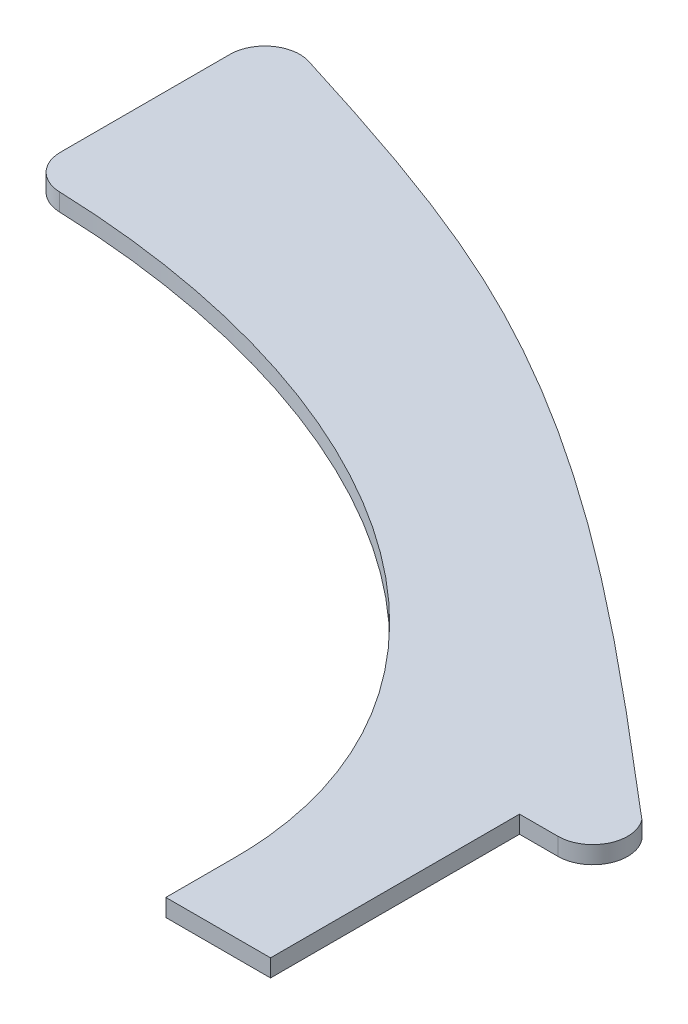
from build123d import *

# Parameters (mm, degrees)
EXTRUDE1_DEPTH = 6.35


with BuildPart() as part:
    # Sketch1 → Extrude1 (new body)
    with BuildSketch(Plane(origin=(0, 0, 0), x_dir=(1, 0, 0), z_dir=(0, 1, 0))):
        with BuildLine():
            Line((-50.754356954, -0.003057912), (-50.754356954, -25.403057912))
            Line((-50.754356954, -25.403057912), (-12.657224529, -25.403057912))
            Line((-12.657224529, -25.403057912), (-12.657224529, 0))
            Line((-12.657224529, 0), (-12.657224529, 65.192382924))
            Line((-12.657224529, 65.192382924), (1.320655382, 65.192382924))
            ThreePointArc((1.320655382, 65.192382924), (12.750182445, 72.355604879), (11.286443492, 85.764680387))
            add(Edge.make_bspline(
                [(11.286443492, 85.764680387), (-51.996082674, 139.63254735), (-142.555462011, 216.719239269), (-254.377902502, 253.511407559), (-288.282696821, 264.065032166)],
                knots=[0, 0, 0, 0, 0.666316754, 0.953521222, 0.953521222, 0.953521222, 0.953521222], degree=3))
            ThreePointArc((-288.282696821, 264.065032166), (-299.58562071, 262.166967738), (-304.757224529, 251.938905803))
            Line((-304.757224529, 251.938905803), (-304.757224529, 202.348739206))
            Line((-304.757224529, 202.348739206), (-304.757224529, 190.283691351))
            ThreePointArc((-304.757224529, 190.283691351), (-301.188622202, 181.457164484), (-292.488314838, 177.59100995))
            add(Edge.make_bspline(
                [(-50.754356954, -0.003057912), (-50.752318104, 169.380763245), (-292.488314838, 177.59100995)],
                knots=[0, 0, 0, 1.522323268, 1.522323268, 1.522323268], degree=2, weights=[1, 0.724035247, 1]))
        make_face()
    extrude(amount=EXTRUDE1_DEPTH)


solid = part.part
